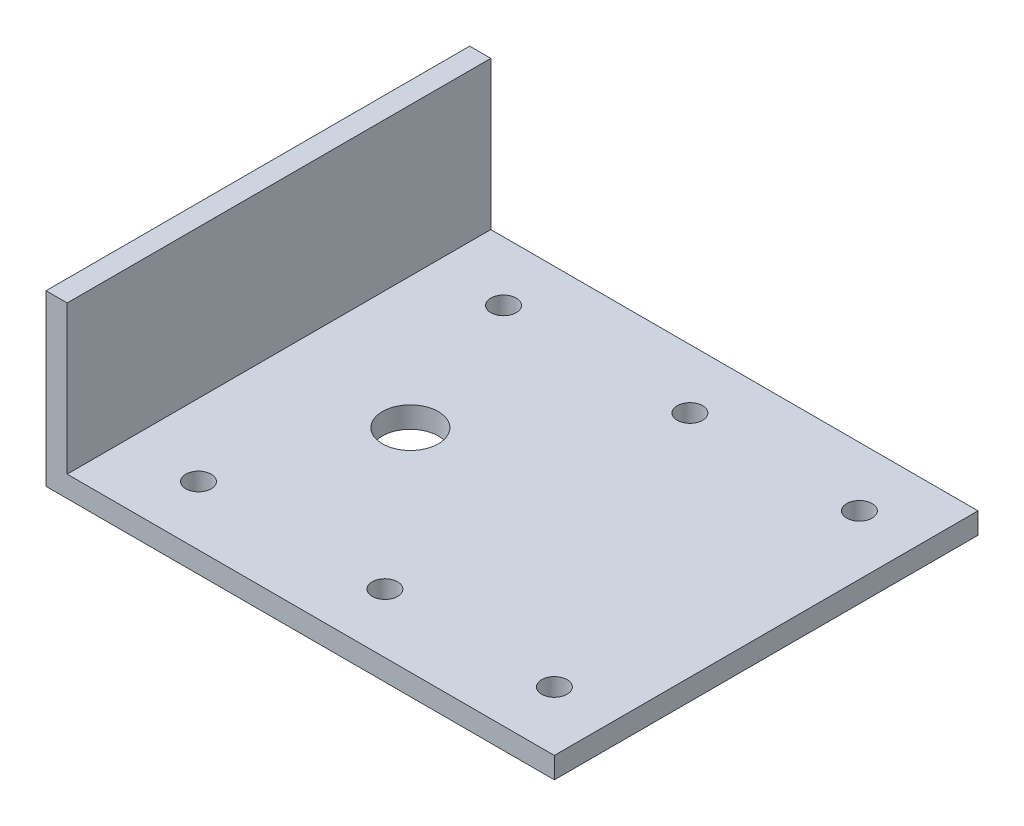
ISO-10303-21;
HEADER;
FILE_DESCRIPTION(('STEP AP214'),'2;1');
FILE_NAME('part.step','',(''),(''),'','','');
FILE_SCHEMA(('AUTOMOTIVE_DESIGN { 1 0 10303 214 1 1 1 1 }'));
ENDSEC;
DATA;
#1=APPLICATION_CONTEXT('core data for automotive mechanical design processes');
#2=APPLICATION_PROTOCOL_DEFINITION('international standard','automotive_design',2000,#1);
#3=PRODUCT_CONTEXT('',#1,'mechanical');
#4=PRODUCT('Part','Part','',(#3));
#5=PRODUCT_RELATED_PRODUCT_CATEGORY('part','',(#4));
#6=PRODUCT_DEFINITION_FORMATION('','',#4);
#7=PRODUCT_DEFINITION_CONTEXT('part definition',#1,'design');
#8=PRODUCT_DEFINITION('design','',#6,#7);
#9=PRODUCT_DEFINITION_SHAPE('','',#8);
#10=(LENGTH_UNIT() NAMED_UNIT(*) SI_UNIT(.MILLI.,.METRE.));
#11=(NAMED_UNIT(*) PLANE_ANGLE_UNIT() SI_UNIT($,.RADIAN.));
#12=(NAMED_UNIT(*) SI_UNIT($,.STERADIAN.) SOLID_ANGLE_UNIT());
#13=UNCERTAINTY_MEASURE_WITH_UNIT(LENGTH_MEASURE(1.E-05),#10,'distance_accuracy_value','');
#14=(GEOMETRIC_REPRESENTATION_CONTEXT(3) GLOBAL_UNCERTAINTY_ASSIGNED_CONTEXT((#13)) GLOBAL_UNIT_ASSIGNED_CONTEXT((#10,
#11,#12)) REPRESENTATION_CONTEXT('',''));
#15=CARTESIAN_POINT('',(0.,0.,0.));
#16=DIRECTION('',(0.,0.,1.));
#17=DIRECTION('',(1.,0.,0.));
#18=AXIS2_PLACEMENT_3D('',#15,#16,#17);
#19=CARTESIAN_POINT('',(2.5,0.,25.));
#20=DIRECTION('',(-1.,0.,0.));
#21=DIRECTION('',(0.,0.,1.));
#22=AXIS2_PLACEMENT_3D('',#19,#20,#21);
#23=PLANE('',#22);
#24=DIRECTION('',(0.,1.,0.));
#25=VECTOR('',#24,1.);
#26=CARTESIAN_POINT('',(2.5,0.,-25.));
#27=LINE('',#26,#25);
#28=CARTESIAN_POINT('',(2.5,2.5,-25.));
#29=VERTEX_POINT('',#28);
#30=CARTESIAN_POINT('',(2.5,20.,-25.));
#31=VERTEX_POINT('',#30);
#32=EDGE_CURVE('E116',#29,#31,#27,.T.);
#33=ORIENTED_EDGE('',*,*,#32,.T.);
#34=DIRECTION('',(0.,0.,-1.));
#35=VECTOR('',#34,1.);
#36=CARTESIAN_POINT('',(2.5,20.,25.));
#37=LINE('',#36,#35);
#38=CARTESIAN_POINT('',(2.5,20.,25.));
#39=VERTEX_POINT('',#38);
#40=EDGE_CURVE('E11',#39,#31,#37,.T.);
#41=ORIENTED_EDGE('',*,*,#40,.F.);
#42=DIRECTION('',(0.,1.,0.));
#43=VECTOR('',#42,1.);
#44=CARTESIAN_POINT('',(2.5,0.,25.));
#45=LINE('',#44,#43);
#46=CARTESIAN_POINT('',(2.5,2.5,25.));
#47=VERTEX_POINT('',#46);
#48=EDGE_CURVE('E81',#47,#39,#45,.T.);
#49=ORIENTED_EDGE('',*,*,#48,.F.);
#50=DIRECTION('',(0.,0.,-1.));
#51=VECTOR('',#50,1.);
#52=CARTESIAN_POINT('',(2.5,2.5,25.));
#53=LINE('',#52,#51);
#54=EDGE_CURVE('E112',#47,#29,#53,.T.);
#55=ORIENTED_EDGE('',*,*,#54,.T.);
#56=EDGE_LOOP('',(#33,#41,#49,#55));
#57=FACE_BOUND('',#56,.T.);
#58=ADVANCED_FACE('F35',(#57),#23,.F.);
#59=CARTESIAN_POINT('',(0.,20.,25.));
#60=DIRECTION('',(0.,1.,0.));
#61=DIRECTION('',(0.,0.,1.));
#62=AXIS2_PLACEMENT_3D('',#59,#60,#61);
#63=PLANE('',#62);
#64=DIRECTION('',(1.,0.,0.));
#65=VECTOR('',#64,1.);
#66=CARTESIAN_POINT('',(0.,20.,-25.));
#67=LINE('',#66,#65);
#68=CARTESIAN_POINT('',(0.,20.,-25.));
#69=VERTEX_POINT('',#68);
#70=EDGE_CURVE('E119',#69,#31,#67,.T.);
#71=ORIENTED_EDGE('',*,*,#70,.F.);
#72=DIRECTION('',(0.,0.,-1.));
#73=VECTOR('',#72,1.);
#74=CARTESIAN_POINT('',(0.,20.,25.));
#75=LINE('',#74,#73);
#76=CARTESIAN_POINT('',(0.,20.,25.));
#77=VERTEX_POINT('',#76);
#78=EDGE_CURVE('E43',#77,#69,#75,.T.);
#79=ORIENTED_EDGE('',*,*,#78,.F.);
#80=DIRECTION('',(1.,0.,0.));
#81=VECTOR('',#80,1.);
#82=CARTESIAN_POINT('',(0.,20.,25.));
#83=LINE('',#82,#81);
#84=EDGE_CURVE('E206',#77,#39,#83,.T.);
#85=ORIENTED_EDGE('',*,*,#84,.T.);
#86=ORIENTED_EDGE('',*,*,#40,.T.);
#87=EDGE_LOOP('',(#71,#79,#85,#86));
#88=FACE_BOUND('',#87,.T.);
#89=ADVANCED_FACE('F138',(#88),#63,.T.);
#90=CARTESIAN_POINT('',(0.,0.,25.));
#91=DIRECTION('',(-1.,0.,0.));
#92=DIRECTION('',(0.,0.,1.));
#93=AXIS2_PLACEMENT_3D('',#90,#91,#92);
#94=PLANE('',#93);
#95=DIRECTION('',(0.,1.,0.));
#96=VECTOR('',#95,1.);
#97=CARTESIAN_POINT('',(0.,0.,-25.));
#98=LINE('',#97,#96);
#99=CARTESIAN_POINT('',(0.,0.,-25.));
#100=VERTEX_POINT('',#99);
#101=EDGE_CURVE('E123',#100,#69,#98,.T.);
#102=ORIENTED_EDGE('',*,*,#101,.F.);
#103=DIRECTION('',(0.,0.,-1.));
#104=VECTOR('',#103,1.);
#105=CARTESIAN_POINT('',(0.,0.,25.));
#106=LINE('',#105,#104);
#107=CARTESIAN_POINT('',(0.,0.,25.));
#108=VERTEX_POINT('',#107);
#109=EDGE_CURVE('E102',#108,#100,#106,.T.);
#110=ORIENTED_EDGE('',*,*,#109,.F.);
#111=DIRECTION('',(0.,1.,0.));
#112=VECTOR('',#111,1.);
#113=CARTESIAN_POINT('',(0.,0.,25.));
#114=LINE('',#113,#112);
#115=EDGE_CURVE('E108',#108,#77,#114,.T.);
#116=ORIENTED_EDGE('',*,*,#115,.T.);
#117=ORIENTED_EDGE('',*,*,#78,.T.);
#118=EDGE_LOOP('',(#102,#110,#116,#117));
#119=FACE_BOUND('',#118,.T.);
#120=ADVANCED_FACE('F135',(#119),#94,.T.);
#121=CARTESIAN_POINT('',(0.,0.,25.));
#122=DIRECTION('',(0.,-1.,0.));
#123=DIRECTION('',(0.,0.,-1.));
#124=AXIS2_PLACEMENT_3D('',#121,#122,#123);
#125=PLANE('',#124);
#126=CARTESIAN_POINT('',(11.,0.,-18.));
#127=DIRECTION('',(0.,-1.,0.));
#128=DIRECTION('',(0.,0.,-1.));
#129=AXIS2_PLACEMENT_3D('',#126,#127,#128);
#130=CIRCLE('',#129,1.5);
#131=CARTESIAN_POINT('',(11.,0.,-19.5));
#132=VERTEX_POINT('',#131);
#133=EDGE_CURVE('E172',#132,#132,#130,.T.);
#134=ORIENTED_EDGE('',*,*,#133,.F.);
#135=EDGE_LOOP('',(#134));
#136=FACE_BOUND('',#135,.T.);
#137=CARTESIAN_POINT('',(11.,0.,18.));
#138=DIRECTION('',(0.,-1.,0.));
#139=DIRECTION('',(0.,0.,-1.));
#140=AXIS2_PLACEMENT_3D('',#137,#138,#139);
#141=CIRCLE('',#140,1.5);
#142=CARTESIAN_POINT('',(11.,0.,16.5));
#143=VERTEX_POINT('',#142);
#144=EDGE_CURVE('E176',#143,#143,#141,.T.);
#145=ORIENTED_EDGE('',*,*,#144,.F.);
#146=EDGE_LOOP('',(#145));
#147=FACE_BOUND('',#146,.T.);
#148=CARTESIAN_POINT('',(33.,0.,-18.));
#149=DIRECTION('',(0.,-1.,0.));
#150=DIRECTION('',(0.,0.,-1.));
#151=AXIS2_PLACEMENT_3D('',#148,#149,#150);
#152=CIRCLE('',#151,1.5);
#153=CARTESIAN_POINT('',(33.,0.,-19.5));
#154=VERTEX_POINT('',#153);
#155=EDGE_CURVE('E180',#154,#154,#152,.T.);
#156=ORIENTED_EDGE('',*,*,#155,.F.);
#157=EDGE_LOOP('',(#156));
#158=FACE_BOUND('',#157,.T.);
#159=CARTESIAN_POINT('',(33.,0.,18.));
#160=DIRECTION('',(0.,-1.,0.));
#161=DIRECTION('',(0.,0.,-1.));
#162=AXIS2_PLACEMENT_3D('',#159,#160,#161);
#163=CIRCLE('',#162,1.5);
#164=CARTESIAN_POINT('',(33.,0.,16.5));
#165=VERTEX_POINT('',#164);
#166=EDGE_CURVE('E184',#165,#165,#163,.T.);
#167=ORIENTED_EDGE('',*,*,#166,.F.);
#168=EDGE_LOOP('',(#167));
#169=FACE_BOUND('',#168,.T.);
#170=CARTESIAN_POINT('',(53.,0.,-18.));
#171=DIRECTION('',(0.,-1.,0.));
#172=DIRECTION('',(0.,0.,-1.));
#173=AXIS2_PLACEMENT_3D('',#170,#171,#172);
#174=CIRCLE('',#173,1.5);
#175=CARTESIAN_POINT('',(53.,0.,-19.5));
#176=VERTEX_POINT('',#175);
#177=EDGE_CURVE('E188',#176,#176,#174,.T.);
#178=ORIENTED_EDGE('',*,*,#177,.F.);
#179=EDGE_LOOP('',(#178));
#180=FACE_BOUND('',#179,.T.);
#181=CARTESIAN_POINT('',(53.,0.,18.));
#182=DIRECTION('',(0.,-1.,0.));
#183=DIRECTION('',(0.,0.,-1.));
#184=AXIS2_PLACEMENT_3D('',#181,#182,#183);
#185=CIRCLE('',#184,1.5);
#186=CARTESIAN_POINT('',(53.,0.,16.5));
#187=VERTEX_POINT('',#186);
#188=EDGE_CURVE('E192',#187,#187,#185,.T.);
#189=ORIENTED_EDGE('',*,*,#188,.F.);
#190=EDGE_LOOP('',(#189));
#191=FACE_BOUND('',#190,.T.);
#192=CARTESIAN_POINT('',(18.,0.,0.));
#193=DIRECTION('',(0.,-1.,0.));
#194=DIRECTION('',(0.,0.,-1.));
#195=AXIS2_PLACEMENT_3D('',#192,#193,#194);
#196=CIRCLE('',#195,3.29999999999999);
#197=CARTESIAN_POINT('',(18.,0.,-3.29999999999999));
#198=VERTEX_POINT('',#197);
#199=EDGE_CURVE('E195',#198,#198,#196,.T.);
#200=ORIENTED_EDGE('',*,*,#199,.F.);
#201=EDGE_LOOP('',(#200));
#202=FACE_BOUND('',#201,.T.);
#203=DIRECTION('',(-1.,0.,0.));
#204=VECTOR('',#203,1.);
#205=CARTESIAN_POINT('',(0.,0.,-25.));
#206=LINE('',#205,#204);
#207=CARTESIAN_POINT('',(60.,0.,-25.));
#208=VERTEX_POINT('',#207);
#209=EDGE_CURVE('E97',#208,#100,#206,.T.);
#210=ORIENTED_EDGE('',*,*,#209,.F.);
#211=DIRECTION('',(0.,0.,-1.));
#212=VECTOR('',#211,1.);
#213=CARTESIAN_POINT('',(60.,0.,25.));
#214=LINE('',#213,#212);
#215=CARTESIAN_POINT('',(60.,0.,25.));
#216=VERTEX_POINT('',#215);
#217=EDGE_CURVE('E92',#216,#208,#214,.T.);
#218=ORIENTED_EDGE('',*,*,#217,.F.);
#219=DIRECTION('',(-1.,0.,0.));
#220=VECTOR('',#219,1.);
#221=CARTESIAN_POINT('',(0.,0.,25.));
#222=LINE('',#221,#220);
#223=EDGE_CURVE('E95',#216,#108,#222,.T.);
#224=ORIENTED_EDGE('',*,*,#223,.T.);
#225=ORIENTED_EDGE('',*,*,#109,.T.);
#226=EDGE_LOOP('',(#210,#218,#224,#225));
#227=FACE_BOUND('',#226,.T.);
#228=ADVANCED_FACE('F94',(#136,#147,#158,#169,#180,#191,#202,#227),#125,.T.);
#229=CARTESIAN_POINT('',(60.,2.5,25.));
#230=DIRECTION('',(1.,0.,0.));
#231=DIRECTION('',(0.,0.,-1.));
#232=AXIS2_PLACEMENT_3D('',#229,#230,#231);
#233=PLANE('',#232);
#234=DIRECTION('',(0.,-1.,0.));
#235=VECTOR('',#234,1.);
#236=CARTESIAN_POINT('',(60.,2.5,-25.));
#237=LINE('',#236,#235);
#238=CARTESIAN_POINT('',(60.,2.5,-25.));
#239=VERTEX_POINT('',#238);
#240=EDGE_CURVE('E127',#239,#208,#237,.T.);
#241=ORIENTED_EDGE('',*,*,#240,.F.);
#242=DIRECTION('',(0.,0.,-1.));
#243=VECTOR('',#242,1.);
#244=CARTESIAN_POINT('',(60.,2.5,25.));
#245=LINE('',#244,#243);
#246=CARTESIAN_POINT('',(60.,2.5,25.));
#247=VERTEX_POINT('',#246);
#248=EDGE_CURVE('E72',#247,#239,#245,.T.);
#249=ORIENTED_EDGE('',*,*,#248,.F.);
#250=DIRECTION('',(0.,-1.,0.));
#251=VECTOR('',#250,1.);
#252=CARTESIAN_POINT('',(60.,2.5,25.));
#253=LINE('',#252,#251);
#254=EDGE_CURVE('E106',#247,#216,#253,.T.);
#255=ORIENTED_EDGE('',*,*,#254,.T.);
#256=ORIENTED_EDGE('',*,*,#217,.T.);
#257=EDGE_LOOP('',(#241,#249,#255,#256));
#258=FACE_BOUND('',#257,.T.);
#259=ADVANCED_FACE('F110',(#258),#233,.T.);
#260=CARTESIAN_POINT('',(0.,2.5,25.));
#261=DIRECTION('',(0.,-1.,0.));
#262=DIRECTION('',(0.,0.,-1.));
#263=AXIS2_PLACEMENT_3D('',#260,#261,#262);
#264=PLANE('',#263);
#265=CARTESIAN_POINT('',(11.,2.5,-18.));
#266=DIRECTION('',(0.,-1.,0.));
#267=DIRECTION('',(0.,0.,-1.));
#268=AXIS2_PLACEMENT_3D('',#265,#266,#267);
#269=CIRCLE('',#268,1.5);
#270=CARTESIAN_POINT('',(11.,2.5,-19.5));
#271=VERTEX_POINT('',#270);
#272=EDGE_CURVE('E224',#271,#271,#269,.F.);
#273=ORIENTED_EDGE('',*,*,#272,.F.);
#274=EDGE_LOOP('',(#273));
#275=FACE_BOUND('',#274,.T.);
#276=CARTESIAN_POINT('',(11.,2.5,18.));
#277=DIRECTION('',(0.,-1.,0.));
#278=DIRECTION('',(0.,0.,-1.));
#279=AXIS2_PLACEMENT_3D('',#276,#277,#278);
#280=CIRCLE('',#279,1.5);
#281=CARTESIAN_POINT('',(11.,2.5,16.5));
#282=VERTEX_POINT('',#281);
#283=EDGE_CURVE('E220',#282,#282,#280,.F.);
#284=ORIENTED_EDGE('',*,*,#283,.F.);
#285=EDGE_LOOP('',(#284));
#286=FACE_BOUND('',#285,.T.);
#287=CARTESIAN_POINT('',(33.,2.5,-18.));
#288=DIRECTION('',(0.,-1.,0.));
#289=DIRECTION('',(0.,0.,-1.));
#290=AXIS2_PLACEMENT_3D('',#287,#288,#289);
#291=CIRCLE('',#290,1.5);
#292=CARTESIAN_POINT('',(33.,2.5,-19.5));
#293=VERTEX_POINT('',#292);
#294=EDGE_CURVE('E216',#293,#293,#291,.F.);
#295=ORIENTED_EDGE('',*,*,#294,.F.);
#296=EDGE_LOOP('',(#295));
#297=FACE_BOUND('',#296,.T.);
#298=CARTESIAN_POINT('',(33.,2.5,18.));
#299=DIRECTION('',(0.,-1.,0.));
#300=DIRECTION('',(0.,0.,-1.));
#301=AXIS2_PLACEMENT_3D('',#298,#299,#300);
#302=CIRCLE('',#301,1.5);
#303=CARTESIAN_POINT('',(33.,2.5,16.5));
#304=VERTEX_POINT('',#303);
#305=EDGE_CURVE('E212',#304,#304,#302,.F.);
#306=ORIENTED_EDGE('',*,*,#305,.F.);
#307=EDGE_LOOP('',(#306));
#308=FACE_BOUND('',#307,.T.);
#309=CARTESIAN_POINT('',(53.,2.5,-18.));
#310=DIRECTION('',(0.,-1.,0.));
#311=DIRECTION('',(0.,0.,-1.));
#312=AXIS2_PLACEMENT_3D('',#309,#310,#311);
#313=CIRCLE('',#312,1.5);
#314=CARTESIAN_POINT('',(53.,2.5,-19.5));
#315=VERTEX_POINT('',#314);
#316=EDGE_CURVE('E208',#315,#315,#313,.F.);
#317=ORIENTED_EDGE('',*,*,#316,.F.);
#318=EDGE_LOOP('',(#317));
#319=FACE_BOUND('',#318,.T.);
#320=CARTESIAN_POINT('',(53.,2.5,18.));
#321=DIRECTION('',(0.,-1.,0.));
#322=DIRECTION('',(0.,0.,-1.));
#323=AXIS2_PLACEMENT_3D('',#320,#321,#322);
#324=CIRCLE('',#323,1.5);
#325=CARTESIAN_POINT('',(53.,2.5,16.5));
#326=VERTEX_POINT('',#325);
#327=EDGE_CURVE('E197',#326,#326,#324,.F.);
#328=ORIENTED_EDGE('',*,*,#327,.F.);
#329=EDGE_LOOP('',(#328));
#330=FACE_BOUND('',#329,.T.);
#331=CARTESIAN_POINT('',(18.,2.5,0.));
#332=DIRECTION('',(0.,-1.,0.));
#333=DIRECTION('',(0.,0.,-1.));
#334=AXIS2_PLACEMENT_3D('',#331,#332,#333);
#335=CIRCLE('',#334,3.29999999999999);
#336=CARTESIAN_POINT('',(18.,2.5,-3.29999999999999));
#337=VERTEX_POINT('',#336);
#338=EDGE_CURVE('E120',#337,#337,#335,.T.);
#339=ORIENTED_EDGE('',*,*,#338,.T.);
#340=EDGE_LOOP('',(#339));
#341=FACE_BOUND('',#340,.T.);
#342=DIRECTION('',(1.,0.,0.));
#343=VECTOR('',#342,1.);
#344=CARTESIAN_POINT('',(0.,2.5,-25.));
#345=LINE('',#344,#343);
#346=EDGE_CURVE('E75',#239,#29,#345,.F.);
#347=ORIENTED_EDGE('',*,*,#346,.T.);
#348=ORIENTED_EDGE('',*,*,#54,.F.);
#349=DIRECTION('',(1.,0.,0.));
#350=VECTOR('',#349,1.);
#351=CARTESIAN_POINT('',(0.,2.5,25.));
#352=LINE('',#351,#350);
#353=EDGE_CURVE('E51',#247,#47,#352,.F.);
#354=ORIENTED_EDGE('',*,*,#353,.F.);
#355=ORIENTED_EDGE('',*,*,#248,.T.);
#356=EDGE_LOOP('',(#347,#348,#354,#355));
#357=FACE_BOUND('',#356,.T.);
#358=ADVANCED_FACE('F143',(#275,#286,#297,#308,#319,#330,#341,#357),#264,.F.);
#359=CARTESIAN_POINT('',(2.5,20.,25.));
#360=DIRECTION('',(0.,0.,-1.));
#361=DIRECTION('',(-1.,0.,0.));
#362=AXIS2_PLACEMENT_3D('',#359,#360,#361);
#363=PLANE('',#362);
#364=ORIENTED_EDGE('',*,*,#48,.T.);
#365=ORIENTED_EDGE('',*,*,#84,.F.);
#366=ORIENTED_EDGE('',*,*,#115,.F.);
#367=ORIENTED_EDGE('',*,*,#223,.F.);
#368=ORIENTED_EDGE('',*,*,#254,.F.);
#369=ORIENTED_EDGE('',*,*,#353,.T.);
#370=EDGE_LOOP('',(#364,#365,#366,#367,#368,#369));
#371=FACE_BOUND('',#370,.T.);
#372=ADVANCED_FACE('F105',(#371),#363,.F.);
#373=CARTESIAN_POINT('',(2.5,20.,-25.));
#374=DIRECTION('',(0.,0.,-1.));
#375=DIRECTION('',(-1.,0.,0.));
#376=AXIS2_PLACEMENT_3D('',#373,#374,#375);
#377=PLANE('',#376);
#378=ORIENTED_EDGE('',*,*,#32,.F.);
#379=ORIENTED_EDGE('',*,*,#346,.F.);
#380=ORIENTED_EDGE('',*,*,#240,.T.);
#381=ORIENTED_EDGE('',*,*,#209,.T.);
#382=ORIENTED_EDGE('',*,*,#101,.T.);
#383=ORIENTED_EDGE('',*,*,#70,.T.);
#384=EDGE_LOOP('',(#378,#379,#380,#381,#382,#383));
#385=FACE_BOUND('',#384,.T.);
#386=ADVANCED_FACE('F141',(#385),#377,.T.);
#387=CARTESIAN_POINT('',(18.,0.,0.));
#388=DIRECTION('',(0.,-1.,0.));
#389=DIRECTION('',(0.,0.,-1.));
#390=AXIS2_PLACEMENT_3D('',#387,#388,#389);
#391=CYLINDRICAL_SURFACE('',#390,3.29999999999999);
#392=ORIENTED_EDGE('',*,*,#199,.T.);
#393=EDGE_LOOP('',(#392));
#394=FACE_BOUND('',#393,.T.);
#395=ORIENTED_EDGE('',*,*,#338,.F.);
#396=EDGE_LOOP('',(#395));
#397=FACE_BOUND('',#396,.T.);
#398=ADVANCED_FACE('F254',(#394,#397),#391,.F.);
#399=CARTESIAN_POINT('',(53.,20.001,18.));
#400=DIRECTION('',(0.,-1.,0.));
#401=DIRECTION('',(0.,0.,-1.));
#402=AXIS2_PLACEMENT_3D('',#399,#400,#401);
#403=CYLINDRICAL_SURFACE('',#402,1.5);
#404=ORIENTED_EDGE('',*,*,#188,.T.);
#405=EDGE_LOOP('',(#404));
#406=FACE_BOUND('',#405,.T.);
#407=ORIENTED_EDGE('',*,*,#327,.T.);
#408=EDGE_LOOP('',(#407));
#409=FACE_BOUND('',#408,.T.);
#410=ADVANCED_FACE('F250',(#406,#409),#403,.F.);
#411=CARTESIAN_POINT('',(53.,20.001,-18.));
#412=DIRECTION('',(0.,-1.,0.));
#413=DIRECTION('',(0.,0.,-1.));
#414=AXIS2_PLACEMENT_3D('',#411,#412,#413);
#415=CYLINDRICAL_SURFACE('',#414,1.5);
#416=ORIENTED_EDGE('',*,*,#177,.T.);
#417=EDGE_LOOP('',(#416));
#418=FACE_BOUND('',#417,.T.);
#419=ORIENTED_EDGE('',*,*,#316,.T.);
#420=EDGE_LOOP('',(#419));
#421=FACE_BOUND('',#420,.T.);
#422=ADVANCED_FACE('F246',(#418,#421),#415,.F.);
#423=CARTESIAN_POINT('',(33.,20.001,18.));
#424=DIRECTION('',(0.,-1.,0.));
#425=DIRECTION('',(0.,0.,-1.));
#426=AXIS2_PLACEMENT_3D('',#423,#424,#425);
#427=CYLINDRICAL_SURFACE('',#426,1.5);
#428=ORIENTED_EDGE('',*,*,#166,.T.);
#429=EDGE_LOOP('',(#428));
#430=FACE_BOUND('',#429,.T.);
#431=ORIENTED_EDGE('',*,*,#305,.T.);
#432=EDGE_LOOP('',(#431));
#433=FACE_BOUND('',#432,.T.);
#434=ADVANCED_FACE('F242',(#430,#433),#427,.F.);
#435=CARTESIAN_POINT('',(33.,20.001,-18.));
#436=DIRECTION('',(0.,-1.,0.));
#437=DIRECTION('',(0.,0.,-1.));
#438=AXIS2_PLACEMENT_3D('',#435,#436,#437);
#439=CYLINDRICAL_SURFACE('',#438,1.5);
#440=ORIENTED_EDGE('',*,*,#155,.T.);
#441=EDGE_LOOP('',(#440));
#442=FACE_BOUND('',#441,.T.);
#443=ORIENTED_EDGE('',*,*,#294,.T.);
#444=EDGE_LOOP('',(#443));
#445=FACE_BOUND('',#444,.T.);
#446=ADVANCED_FACE('F236',(#442,#445),#439,.F.);
#447=CARTESIAN_POINT('',(11.,20.001,18.));
#448=DIRECTION('',(0.,-1.,0.));
#449=DIRECTION('',(0.,0.,-1.));
#450=AXIS2_PLACEMENT_3D('',#447,#448,#449);
#451=CYLINDRICAL_SURFACE('',#450,1.5);
#452=ORIENTED_EDGE('',*,*,#144,.T.);
#453=EDGE_LOOP('',(#452));
#454=FACE_BOUND('',#453,.T.);
#455=ORIENTED_EDGE('',*,*,#283,.T.);
#456=EDGE_LOOP('',(#455));
#457=FACE_BOUND('',#456,.T.);
#458=ADVANCED_FACE('F231',(#454,#457),#451,.F.);
#459=CARTESIAN_POINT('',(11.,20.001,-18.));
#460=DIRECTION('',(0.,-1.,0.));
#461=DIRECTION('',(0.,0.,-1.));
#462=AXIS2_PLACEMENT_3D('',#459,#460,#461);
#463=CYLINDRICAL_SURFACE('',#462,1.5);
#464=ORIENTED_EDGE('',*,*,#133,.T.);
#465=EDGE_LOOP('',(#464));
#466=FACE_BOUND('',#465,.T.);
#467=ORIENTED_EDGE('',*,*,#272,.T.);
#468=EDGE_LOOP('',(#467));
#469=FACE_BOUND('',#468,.T.);
#470=ADVANCED_FACE('F228',(#466,#469),#463,.F.);
#471=CLOSED_SHELL('',(#58,#89,#120,#228,#259,#358,#372,#386,#398,#410,#422,#434,#446,#458,#470));
#472=MANIFOLD_SOLID_BREP('B2',#471);
#473=ADVANCED_BREP_SHAPE_REPRESENTATION('',(#18,#472),#14);
#474=SHAPE_DEFINITION_REPRESENTATION(#9,#473);
ENDSEC;
END-ISO-10303-21;
